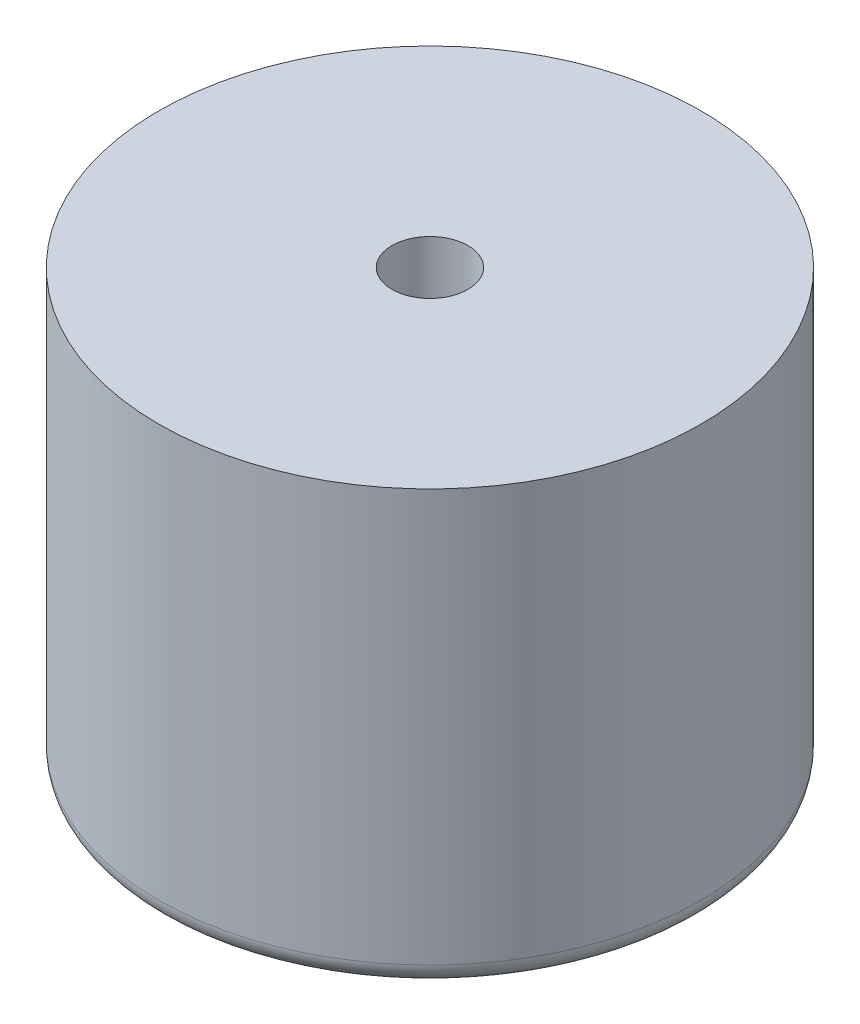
from build123d import *

# Parameters (mm, degrees)
SKETCH_1_R                  = 25
EXTRUDE_1_DEPTH             = 40
FILLET_1_R                  = 2
HOLE_WIZARD_M61_D           = 7
HOLE_WIZARD_M61_CSINK_D     = 17
HOLE_WIZARD_M61_CSINK_ANGLE = 90


with BuildPart() as part:
    # Sketch 1 → Extrude 1 (new body)
    with BuildSketch(Plane(origin=(0, 0, 0), x_dir=(1, 0, 0), z_dir=(0, 1, 0))):
        with Locations(Location((0, 0, 0), (0, 0, 270))):
            Circle(SKETCH_1_R)
    extrude(amount=EXTRUDE_1_DEPTH)

    # Fillet 1
    fillet_1_edges = [part.edges().sort_by_distance(p)[0] for p in [
        (0, 0, -25),
    ]]
    fillet(fillet_1_edges, radius=FILLET_1_R)

    # Hole Wizard M61 (through all)
    with Locations(Plane(origin=(0, 0, 0), x_dir=(-1, 0, 0), z_dir=(0, -1, 0))):
        with Locations((0, 0)):
            CounterSinkHole(HOLE_WIZARD_M61_D / 2, HOLE_WIZARD_M61_CSINK_D / 2, counter_sink_angle=HOLE_WIZARD_M61_CSINK_ANGLE)


solid = part.part
